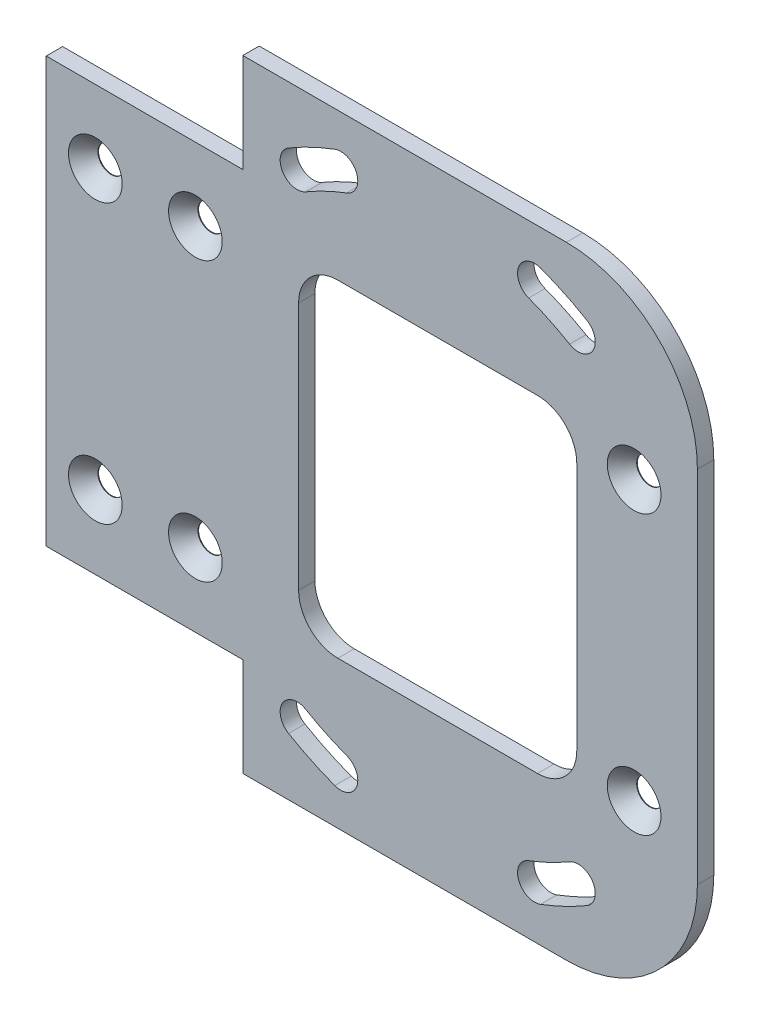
from build123d import *

# Parameters (mm, degrees)
BOSS_EXTRUDE1_DEPTH = 3.175
SKETCH6_W           = 53.9496
SKETCH6_H           = 63.5
CUT_EXTRUDE3_DEPTH  = 98.021953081
CUT_EXTRUDE4_DEPTH  = 98.021953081
CUT_EXTRUDE5_DEPTH  = 98.021953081
CUT_EXTRUDE6_DEPTH  = 98.021953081
CUT_EXTRUDE7_DEPTH  = 98.021953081
HOLE1_AT_2_COUNT    = 2
HOLE1_AT_2_PITCH    = 19.4056
HOLE1_AT_3_COUNT    = 2
HOLE1_AT_3_PITCH    = 53.975
HOLE1_AT_4_COUNT    = 2
HOLE1_AT_4_PITCH    = 57.357457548
HOLE1_AT_5_COUNT    = 2
HOLE1_AT_5_PITCH    = 85.09
HOLE1_AT_6_COUNT    = 2
HOLE1_AT_6_PITCH    = 100.765116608
FILLET3_R           = 7.62
FILLET6_R           = 25.4


with BuildPart() as part:
    # Sketch1 → Boss-Extrude1 (new body)
    with BuildSketch(Plane.XY.offset(3.175)):
        Polygon((-75.9206, -41.219029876), (-75.9206, 41.115789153), (-37.787104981, 41.115789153), (-37.787104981, 60.274468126), (50.370861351, 60.274468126), (50.370861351, -60.326124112), (-37.787104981, -60.326124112), (-37.787104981, -41.219029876), align=None)
    extrude(amount=-BOSS_EXTRUDE1_DEPTH)

    # Sketch6 → Cut-Extrude3 (cut, through all)
    with BuildSketch(Plane.XY.offset(3.175)):
        Rectangle(SKETCH6_W, SKETCH6_H)
    extrude(amount=-CUT_EXTRUDE3_DEPTH, mode=Mode.SUBTRACT)

    # Sketch7 → Cut-Extrude4 (cut, through all)
    with BuildSketch(Plane.XY.offset(3.175)):
        with BuildLine():
            ThreePointArc((-17.642736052, 47.25051134), (-15.704374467, 51.498941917), (-19.952805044, 53.437303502))
            ThreePointArc((-19.952805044, 53.437303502), (-24.534246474, 51.494956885), (-28.928967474, 49.160702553))
            ThreePointArc((-28.928967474, 49.160702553), (-30.100148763, 44.640222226), (-25.579668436, 43.469040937))
            ThreePointArc((-25.579668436, 43.469040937), (-21.693753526, 45.533043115), (-17.642736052, 47.25051134))
        make_face()
    extrude(amount=-CUT_EXTRUDE4_DEPTH, mode=Mode.SUBTRACT)

    # Sketch8 → Cut-Extrude5 (cut, through all)
    with BuildSketch(Plane.XY.offset(3.175)):
        with BuildLine():
            ThreePointArc((28.928967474, 49.160702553), (24.534246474, 51.494956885), (19.952805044, 53.437303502))
            ThreePointArc((19.952805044, 53.437303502), (15.704374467, 51.498941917), (17.642736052, 47.25051134))
            ThreePointArc((17.642736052, 47.25051134), (21.693753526, 45.533043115), (25.579668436, 43.469040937))
            ThreePointArc((25.579668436, 43.469040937), (30.100148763, 44.640222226), (28.928967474, 49.160702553))
        make_face()
    extrude(amount=-CUT_EXTRUDE5_DEPTH, mode=Mode.SUBTRACT)

    # Sketch9 → Cut-Extrude6 (cut, through all)
    with BuildSketch(Plane.XY.offset(3.175)):
        with BuildLine():
            ThreePointArc((-19.952805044, -53.437303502), (-15.704374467, -51.498941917), (-17.642736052, -47.25051134))
            ThreePointArc((-17.642736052, -47.25051134), (-21.693753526, -45.533043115), (-25.579668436, -43.469040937))
            ThreePointArc((-25.579668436, -43.469040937), (-30.100148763, -44.640222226), (-28.928967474, -49.160702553))
            ThreePointArc((-28.928967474, -49.160702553), (-24.534246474, -51.494956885), (-19.952805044, -53.437303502))
        make_face()
    extrude(amount=-CUT_EXTRUDE6_DEPTH, mode=Mode.SUBTRACT)

    # Sketch10 → Cut-Extrude7 (cut, through all)
    with BuildSketch(Plane(origin=(0, 0, 0), x_dir=(-1, 0, 0), z_dir=(0, 0, -1))):
        with BuildLine():
            ThreePointArc((-17.642736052, -47.25051134), (-21.693753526, -45.533043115), (-25.579668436, -43.469040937))
            ThreePointArc((-25.579668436, -43.469040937), (-30.100148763, -44.640222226), (-28.928967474, -49.160702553))
            ThreePointArc((-28.928967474, -49.160702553), (-24.534246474, -51.494956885), (-19.952805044, -53.437303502))
            ThreePointArc((-19.952805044, -53.437303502), (-15.704374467, -51.498941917), (-17.642736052, -47.25051134))
        make_face()
    extrude(amount=-CUT_EXTRUDE7_DEPTH, mode=Mode.SUBTRACT)

    # Sketch13 → Hole1 (revolve, cut)
    with BuildSketch(Plane(origin=(-46.99, 26.9875, 3.175), x_dir=(0, -1, 0), z_dir=(1, 0, 0))):
        Polygon((0, 0), (0, 3.175), (2.5527, 3.175), (2.5527, 3.053422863), (5.207, 0), align=None)
    hole1 = revolve(axis=Axis((-46.99, 26.9875, 9.620314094), (0, 0, -1)), mode=Mode.SUBTRACT)

    # Hole1 at 2: Hole1 ×2
    with Locations(*[(-i * HOLE1_AT_2_PITCH, 0, 0) for i in range(1, HOLE1_AT_2_COUNT)]):
        add(hole1, mode=Mode.SUBTRACT)

    # Hole1 at 3: Hole1 ×2
    with Locations(*[(0, -i * HOLE1_AT_3_PITCH, 0) for i in range(1, HOLE1_AT_3_COUNT)]):
        add(hole1, mode=Mode.SUBTRACT)

    # Hole1 at 4: Hole1 ×2
    with Locations(*[Vector(-0.3383274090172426, -0.9410284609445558, 0) * (i * HOLE1_AT_4_PITCH) for i in range(1, HOLE1_AT_4_COUNT)]):
        add(hole1, mode=Mode.SUBTRACT)

    # Hole1 at 5: Hole1 ×2
    with Locations(*[(i * HOLE1_AT_5_PITCH, 0, 0) for i in range(1, HOLE1_AT_5_COUNT)]):
        add(hole1, mode=Mode.SUBTRACT)

    # Hole1 at 6: Hole1 ×2
    with Locations(*[Vector(0.8444390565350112, -0.5356516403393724, 0) * (i * HOLE1_AT_6_PITCH) for i in range(1, HOLE1_AT_6_COUNT)]):
        add(hole1, mode=Mode.SUBTRACT)

    # Fillet3
    fillet3_edges = [part.edges().sort_by_distance(p)[0] for p in [
        (-26.9748, 31.75, 1.5875),
        (26.9748, 31.75, 1.5875),
        (26.9748, -31.75, 1.5875),
        (-26.9748, -31.75, 1.5875),
    ]]
    fillet(fillet3_edges, radius=FILLET3_R)

    # Fillet6
    fillet6_edges = [part.edges().sort_by_distance(p)[0] for p in [
        (50.370861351, -60.326124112, 1.5875),
        (50.370861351, 60.274468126, 1.5875),
    ]]
    fillet(fillet6_edges, radius=FILLET6_R)


solid = part.part
